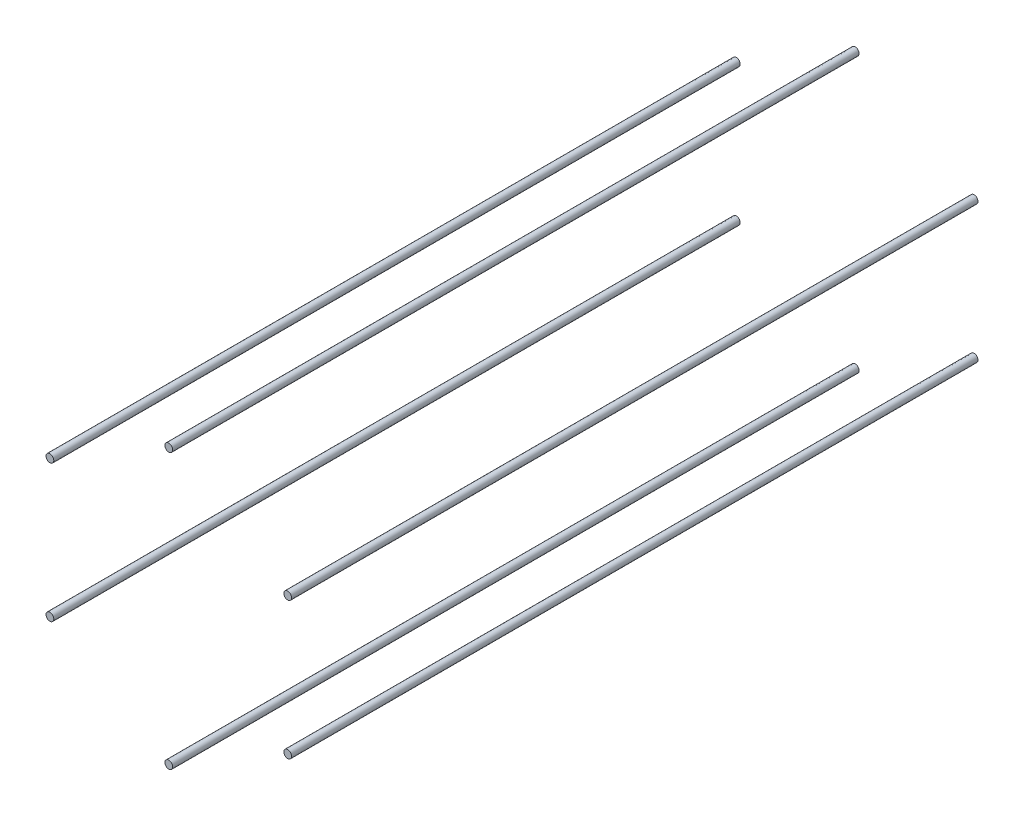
from build123d import *

# Parameters (mm, degrees)
SKETCH2_R             = 6.35
BOSS_EXTRUDE1_DEPTH   = 558.8
BOSS_EXTRUDE1_2_DEPTH = 558.8
BOSS_EXTRUDE1_3_DEPTH = 558.8
BOSS_EXTRUDE1_4_DEPTH = 558.8
BOSS_EXTRUDE1_5_DEPTH = 558.8
BOSS_EXTRUDE1_6_DEPTH = 558.8


with BuildPart() as part:
    # Sketch2 → Boss-Extrude1 (new, symmetric)
    with BuildSketch(Plane(origin=(0, 0, 0), x_dir=(0, 1, 0), z_dir=(0, 0, 1))):
        with Locations(Location((223.528704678, 0, 0), (0, 0, 270))):
            Circle(SKETCH2_R)
    extrude(amount=BOSS_EXTRUDE1_DEPTH, both=True)


with BuildPart() as body_2:
    # Sketch2 → Boss-Extrude1 2 (new, symmetric)
    with BuildSketch(Plane(origin=(0, 0, 0), x_dir=(0, 1, 0), z_dir=(0, 0, 1))):
        with Locations(Location((111.764352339, -193.581536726, 0), (0, 0, 270))):
            Circle(SKETCH2_R)
    extrude(amount=BOSS_EXTRUDE1_2_DEPTH, both=True)


with BuildPart() as body_3:
    # Sketch2 → Boss-Extrude1 3 (new, symmetric)
    with BuildSketch(Plane(origin=(0, 0, 0), x_dir=(0, 1, 0), z_dir=(0, 0, 1))):
        with Locations(Location((-111.764352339, -193.581536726, 0), (0, 0, 270))):
            Circle(SKETCH2_R)
    extrude(amount=BOSS_EXTRUDE1_3_DEPTH, both=True)


with BuildPart() as body_4:
    # Sketch2 → Boss-Extrude1 4 (new, symmetric)
    with BuildSketch(Plane(origin=(0, 0, 0), x_dir=(0, 1, 0), z_dir=(0, 0, 1))):
        with Locations(Location((-223.528704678, 0, 0), (0, 0, 270))):
            Circle(SKETCH2_R)
    extrude(amount=BOSS_EXTRUDE1_4_DEPTH, both=True)


with BuildPart() as body_5:
    # Sketch2 → Boss-Extrude1 5 (new, symmetric)
    with BuildSketch(Plane(origin=(0, 0, 0), x_dir=(0, 1, 0), z_dir=(0, 0, 1))):
        with Locations(Location((-111.764352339, 193.581536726, 0), (0, 0, 270))):
            Circle(SKETCH2_R)
    extrude(amount=BOSS_EXTRUDE1_5_DEPTH, both=True)


with BuildPart() as body_6:
    # Sketch2 → Boss-Extrude1 6 (new, symmetric)
    with BuildSketch(Plane(origin=(0, 0, 0), x_dir=(0, 1, 0), z_dir=(0, 0, 1))):
        with Locations(Location((111.764352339, 193.581536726, 0), (0, 0, 270))):
            Circle(SKETCH2_R)
    extrude(amount=BOSS_EXTRUDE1_6_DEPTH, both=True)


solid = Compound([part.part, body_2.part, body_3.part, body_4.part, body_5.part, body_6.part])
